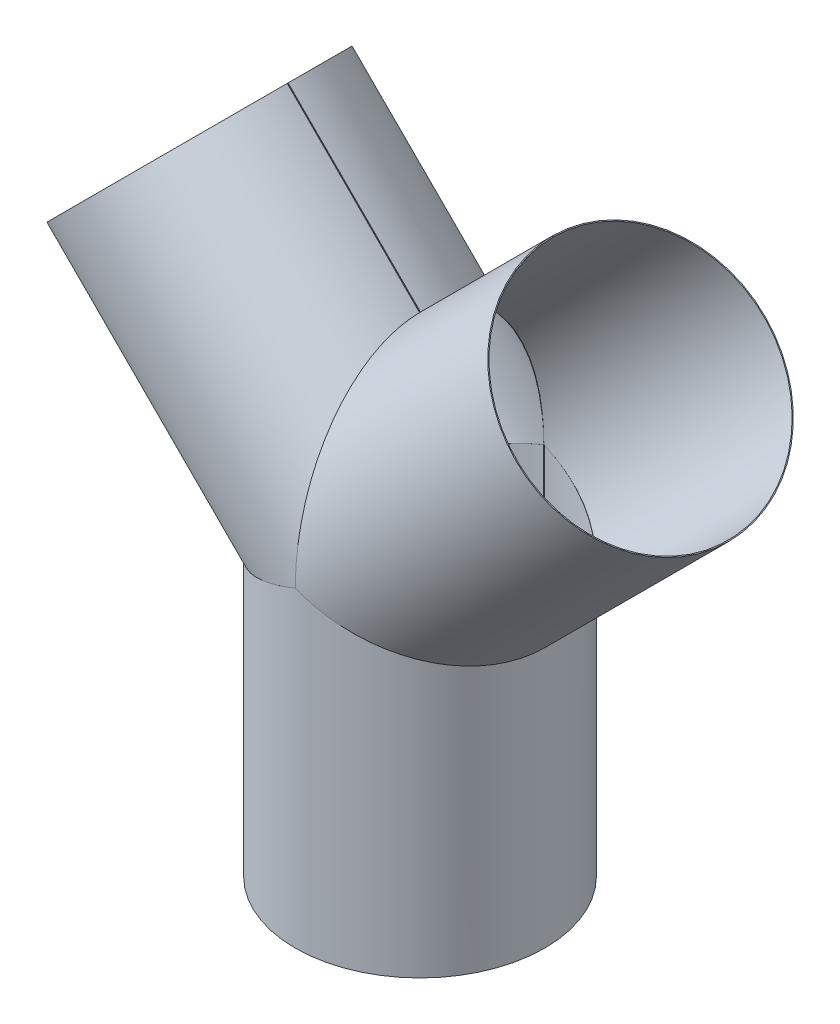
ISO-10303-21;
HEADER;
FILE_DESCRIPTION(('STEP AP214'),'2;1');
FILE_NAME('part.step','',(''),(''),'','','');
FILE_SCHEMA(('AUTOMOTIVE_DESIGN { 1 0 10303 214 1 1 1 1 }'));
ENDSEC;
DATA;
#1=APPLICATION_CONTEXT('core data for automotive mechanical design processes');
#2=APPLICATION_PROTOCOL_DEFINITION('international standard','automotive_design',2000,#1);
#3=PRODUCT_CONTEXT('',#1,'mechanical');
#4=PRODUCT('Part','Part','',(#3));
#5=PRODUCT_RELATED_PRODUCT_CATEGORY('part','',(#4));
#6=PRODUCT_DEFINITION_FORMATION('','',#4);
#7=PRODUCT_DEFINITION_CONTEXT('part definition',#1,'design');
#8=PRODUCT_DEFINITION('design','',#6,#7);
#9=PRODUCT_DEFINITION_SHAPE('','',#8);
#10=(LENGTH_UNIT() NAMED_UNIT(*) SI_UNIT(.MILLI.,.METRE.));
#11=(NAMED_UNIT(*) PLANE_ANGLE_UNIT() SI_UNIT($,.RADIAN.));
#12=(NAMED_UNIT(*) SI_UNIT($,.STERADIAN.) SOLID_ANGLE_UNIT());
#13=UNCERTAINTY_MEASURE_WITH_UNIT(LENGTH_MEASURE(1.E-05),#10,'distance_accuracy_value','');
#14=(GEOMETRIC_REPRESENTATION_CONTEXT(3) GLOBAL_UNCERTAINTY_ASSIGNED_CONTEXT((#13)) GLOBAL_UNIT_ASSIGNED_CONTEXT((#10,
#11,#12)) REPRESENTATION_CONTEXT('',''));
#15=CARTESIAN_POINT('',(0.,0.,0.));
#16=DIRECTION('',(0.,0.,1.));
#17=DIRECTION('',(1.,0.,0.));
#18=AXIS2_PLACEMENT_3D('',#15,#16,#17);
#19=CARTESIAN_POINT('',(0.,0.,0.));
#20=DIRECTION('',(-0.707106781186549,0.707106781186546,0.));
#21=DIRECTION('',(0.707106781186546,0.707106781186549,0.));
#22=AXIS2_PLACEMENT_3D('',#19,#20,#21);
#23=CYLINDRICAL_SURFACE('',#22,200.);
#24=CARTESIAN_POINT('',(0.,0.,0.));
#25=DIRECTION('',(-1.,0.,0.));
#26=DIRECTION('',(0.,1.,0.));
#27=AXIS2_PLACEMENT_3D('',#24,#25,#26);
#28=ELLIPSE('',#27,282.842712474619,200.);
#29=CARTESIAN_POINT('',(0.,282.840723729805,0.750000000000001));
#30=VERTEX_POINT('',#29);
#31=CARTESIAN_POINT('',(0.,0.,200.));
#32=VERTEX_POINT('',#31);
#33=EDGE_CURVE('E147',#30,#32,#28,.F.);
#34=ORIENTED_EDGE('',*,*,#33,.F.);
#35=DIRECTION('',(-0.707106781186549,0.707106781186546,0.));
#36=VECTOR('',#35,1.);
#37=CARTESIAN_POINT('',(141.420361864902,141.420361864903,0.750000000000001));
#38=LINE('',#37,#36);
#39=CARTESIAN_POINT('',(-212.133028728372,494.973752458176,0.750000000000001));
#40=VERTEX_POINT('',#39);
#41=EDGE_CURVE('E13',#30,#40,#38,.T.);
#42=ORIENTED_EDGE('',*,*,#41,.T.);
#43=CARTESIAN_POINT('',(-353.553390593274,353.553390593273,0.));
#44=DIRECTION('',(0.707106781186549,-0.707106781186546,0.));
#45=DIRECTION('',(0.707106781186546,0.707106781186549,0.));
#46=AXIS2_PLACEMENT_3D('',#43,#44,#45);
#47=CIRCLE('',#46,200.);
#48=CARTESIAN_POINT('',(-212.133028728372,494.973752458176,-0.750000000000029));
#49=VERTEX_POINT('',#48);
#50=EDGE_CURVE('E171',#40,#49,#47,.T.);
#51=ORIENTED_EDGE('',*,*,#50,.T.);
#52=DIRECTION('',(-0.707106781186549,0.707106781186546,0.));
#53=VECTOR('',#52,1.);
#54=CARTESIAN_POINT('',(141.420361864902,141.420361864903,-0.750000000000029));
#55=LINE('',#54,#53);
#56=CARTESIAN_POINT('',(0.,282.840723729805,-0.750000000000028));
#57=VERTEX_POINT('',#56);
#58=EDGE_CURVE('E90',#57,#49,#55,.T.);
#59=ORIENTED_EDGE('',*,*,#58,.F.);
#60=CARTESIAN_POINT('',(0.,0.,0.));
#61=DIRECTION('',(-1.,0.,0.));
#62=DIRECTION('',(0.,1.,0.));
#63=AXIS2_PLACEMENT_3D('',#60,#61,#62);
#64=ELLIPSE('',#63,282.842712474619,200.);
#65=CARTESIAN_POINT('',(0.,0.,-200.));
#66=VERTEX_POINT('',#65);
#67=EDGE_CURVE('E165',#66,#57,#64,.F.);
#68=ORIENTED_EDGE('',*,*,#67,.F.);
#69=CARTESIAN_POINT('',(0.,0.,0.));
#70=DIRECTION('',(-0.382683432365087,0.923879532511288,0.));
#71=DIRECTION('',(-0.923879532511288,-0.382683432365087,0.));
#72=AXIS2_PLACEMENT_3D('',#69,#70,#71);
#73=ELLIPSE('',#72,216.478440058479,200.);
#74=EDGE_CURVE('E159',#32,#66,#73,.F.);
#75=ORIENTED_EDGE('',*,*,#74,.F.);
#76=EDGE_LOOP('',(#34,#42,#51,#59,#68,#75));
#77=FACE_BOUND('',#76,.T.);
#78=ADVANCED_FACE('F87',(#77),#23,.T.);
#79=CARTESIAN_POINT('',(0.,0.,0.));
#80=DIRECTION('',(-0.707106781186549,0.707106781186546,0.));
#81=DIRECTION('',(0.707106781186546,0.707106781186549,0.));
#82=AXIS2_PLACEMENT_3D('',#79,#80,#81);
#83=CYLINDRICAL_SURFACE('',#82,198.5);
#84=CARTESIAN_POINT('',(0.,0.,0.));
#85=DIRECTION('',(-0.999992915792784,-0.00376408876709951,0.));
#86=DIRECTION('',(-0.00376408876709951,0.999992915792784,0.));
#87=AXIS2_PLACEMENT_3D('',#84,#85,#86);
#88=ELLIPSE('',#87,281.784048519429,198.5);
#89=CARTESIAN_POINT('',(0.,0.,-198.5));
#90=VERTEX_POINT('',#89);
#91=CARTESIAN_POINT('',(-1.06065271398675,281.780071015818,-0.744375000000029));
#92=VERTEX_POINT('',#91);
#93=EDGE_CURVE('E213',#90,#92,#88,.F.);
#94=ORIENTED_EDGE('',*,*,#93,.T.);
#95=DIRECTION('',(-0.707106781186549,0.707106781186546,0.));
#96=VECTOR('',#95,1.);
#97=CARTESIAN_POINT('',(140.359709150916,140.359709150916,-0.744375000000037));
#98=LINE('',#97,#96);
#99=CARTESIAN_POINT('',(-213.193681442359,493.913099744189,-0.744375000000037));
#100=VERTEX_POINT('',#99);
#101=EDGE_CURVE('E180',#92,#100,#98,.T.);
#102=ORIENTED_EDGE('',*,*,#101,.T.);
#103=CARTESIAN_POINT('',(-353.553390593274,353.553390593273,0.));
#104=DIRECTION('',(0.707106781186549,-0.707106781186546,0.));
#105=DIRECTION('',(0.,0.,-1.));
#106=AXIS2_PLACEMENT_3D('',#103,#104,#105);
#107=CIRCLE('',#106,198.5);
#108=CARTESIAN_POINT('',(-213.193681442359,493.913099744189,0.744375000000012));
#109=VERTEX_POINT('',#108);
#110=EDGE_CURVE('E177',#109,#100,#107,.T.);
#111=ORIENTED_EDGE('',*,*,#110,.F.);
#112=DIRECTION('',(-0.707106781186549,0.707106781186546,0.));
#113=VECTOR('',#112,1.);
#114=CARTESIAN_POINT('',(140.359709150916,140.359709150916,0.744375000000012));
#115=LINE('',#114,#113);
#116=CARTESIAN_POINT('',(-1.06065271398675,281.780071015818,0.744375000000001));
#117=VERTEX_POINT('',#116);
#118=EDGE_CURVE('E95',#117,#109,#115,.T.);
#119=ORIENTED_EDGE('',*,*,#118,.F.);
#120=CARTESIAN_POINT('',(0.,0.,0.));
#121=DIRECTION('',(-0.999992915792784,-0.00376408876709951,0.));
#122=DIRECTION('',(-0.00376408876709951,0.999992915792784,0.));
#123=AXIS2_PLACEMENT_3D('',#120,#121,#122);
#124=ELLIPSE('',#123,281.784048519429,198.5);
#125=CARTESIAN_POINT('',(0.,0.,198.5));
#126=VERTEX_POINT('',#125);
#127=EDGE_CURVE('E144',#117,#126,#124,.F.);
#128=ORIENTED_EDGE('',*,*,#127,.T.);
#129=CARTESIAN_POINT('',(0.,0.,0.));
#130=DIRECTION('',(-0.380216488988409,0.924897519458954,0.));
#131=DIRECTION('',(-0.924897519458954,-0.380216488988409,0.));
#132=AXIS2_PLACEMENT_3D('',#129,#130,#131);
#133=ELLIPSE('',#132,215.093386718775,198.5);
#134=EDGE_CURVE('E151',#126,#90,#133,.F.);
#135=ORIENTED_EDGE('',*,*,#134,.T.);
#136=EDGE_LOOP('',(#94,#102,#111,#119,#128,#135));
#137=FACE_BOUND('',#136,.T.);
#138=ADVANCED_FACE('F161',(#137),#83,.F.);
#139=CARTESIAN_POINT('',(141.420361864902,141.420361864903,0.750000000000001));
#140=DIRECTION('',(-0.002651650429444,-0.00265165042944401,0.999992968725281));
#141=DIRECTION('',(0.,-0.999996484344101,-0.00265165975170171));
#142=AXIS2_PLACEMENT_3D('',#139,#140,#141);
#143=PLANE('',#142);
#144=DIRECTION('',(0.707101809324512,0.707101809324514,0.00375));
#145=VECTOR('',#144,1.);
#146=CARTESIAN_POINT('',(0.,282.840723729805,0.750000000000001));
#147=LINE('',#146,#145);
#148=EDGE_CURVE('E163',#30,#117,#147,.F.);
#149=ORIENTED_EDGE('',*,*,#148,.T.);
#150=ORIENTED_EDGE('',*,*,#118,.T.);
#151=DIRECTION('',(-0.707101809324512,-0.707101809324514,-0.00374999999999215));
#152=VECTOR('',#151,1.);
#153=CARTESIAN_POINT('',(-212.133028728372,494.973752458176,0.750000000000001));
#154=LINE('',#153,#152);
#155=EDGE_CURVE('E103',#40,#109,#154,.T.);
#156=ORIENTED_EDGE('',*,*,#155,.F.);
#157=ORIENTED_EDGE('',*,*,#41,.F.);
#158=EDGE_LOOP('',(#149,#150,#156,#157));
#159=FACE_BOUND('',#158,.T.);
#160=ADVANCED_FACE('F199',(#159),#143,.F.);
#161=CARTESIAN_POINT('',(140.359709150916,140.359709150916,-0.744375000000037));
#162=DIRECTION('',(-0.00265165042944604,-0.00265165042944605,-0.999992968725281));
#163=DIRECTION('',(0.,0.999996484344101,-0.00265165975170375));
#164=AXIS2_PLACEMENT_3D('',#161,#162,#163);
#165=PLANE('',#164);
#166=DIRECTION('',(0.707101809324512,0.707101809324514,-0.00375000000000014));
#167=VECTOR('',#166,1.);
#168=CARTESIAN_POINT('',(0.,282.840723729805,-0.750000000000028));
#169=LINE('',#168,#167);
#170=EDGE_CURVE('E175',#57,#92,#169,.F.);
#171=ORIENTED_EDGE('',*,*,#170,.F.);
#172=ORIENTED_EDGE('',*,*,#58,.T.);
#173=DIRECTION('',(0.707101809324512,0.707101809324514,-0.00374999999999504));
#174=VECTOR('',#173,1.);
#175=CARTESIAN_POINT('',(-213.193681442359,493.913099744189,-0.744375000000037));
#176=LINE('',#175,#174);
#177=EDGE_CURVE('E174',#100,#49,#176,.T.);
#178=ORIENTED_EDGE('',*,*,#177,.F.);
#179=ORIENTED_EDGE('',*,*,#101,.F.);
#180=EDGE_LOOP('',(#171,#172,#178,#179));
#181=FACE_BOUND('',#180,.T.);
#182=ADVANCED_FACE('F186',(#181),#165,.F.);
#183=CARTESIAN_POINT('',(-353.553390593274,353.553390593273,0.));
#184=DIRECTION('',(-0.707106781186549,0.707106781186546,0.));
#185=DIRECTION('',(0.,0.,-1.));
#186=AXIS2_PLACEMENT_3D('',#183,#184,#185);
#187=PLANE('',#186);
#188=ORIENTED_EDGE('',*,*,#50,.F.);
#189=ORIENTED_EDGE('',*,*,#155,.T.);
#190=ORIENTED_EDGE('',*,*,#110,.T.);
#191=ORIENTED_EDGE('',*,*,#177,.T.);
#192=EDGE_LOOP('',(#188,#189,#190,#191));
#193=FACE_BOUND('',#192,.T.);
#194=ADVANCED_FACE('F190',(#193),#187,.T.);
#195=CARTESIAN_POINT('',(0.,282.842712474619,0.));
#196=CARTESIAN_POINT('',(-0.353553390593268,282.489159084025,0.));
#197=CARTESIAN_POINT('',(-0.707106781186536,282.135605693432,0.));
#198=CARTESIAN_POINT('',(-1.0606601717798,281.782052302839,0.));
#199=CARTESIAN_POINT('',(0.,282.842712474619,400.));
#200=CARTESIAN_POINT('',(-0.353553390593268,282.489159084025,399.));
#201=CARTESIAN_POINT('',(-0.707106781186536,282.135605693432,398.));
#202=CARTESIAN_POINT('',(-1.0606601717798,281.782052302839,397.));
#203=CARTESIAN_POINT('',(0.,-282.842712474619,400.));
#204=CARTESIAN_POINT('',(0.353553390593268,-282.489159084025,399.));
#205=CARTESIAN_POINT('',(0.707106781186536,-282.135605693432,398.));
#206=CARTESIAN_POINT('',(1.0606601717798,-281.782052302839,397.));
#207=CARTESIAN_POINT('',(0.,-282.842712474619,0.));
#208=CARTESIAN_POINT('',(0.353553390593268,-282.489159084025,0.));
#209=CARTESIAN_POINT('',(0.707106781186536,-282.135605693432,0.));
#210=CARTESIAN_POINT('',(1.0606601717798,-281.782052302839,0.));
#211=CARTESIAN_POINT('',(0.,-282.842712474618,-400.));
#212=CARTESIAN_POINT('',(0.353553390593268,-282.489159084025,-399.));
#213=CARTESIAN_POINT('',(0.707106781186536,-282.135605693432,-398.));
#214=CARTESIAN_POINT('',(1.0606601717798,-281.782052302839,-397.));
#215=CARTESIAN_POINT('',(0.,282.842712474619,-400.));
#216=CARTESIAN_POINT('',(-0.353553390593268,282.489159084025,-399.));
#217=CARTESIAN_POINT('',(-0.707106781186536,282.135605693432,-398.));
#218=CARTESIAN_POINT('',(-1.0606601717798,281.782052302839,-397.));
#219=CARTESIAN_POINT('',(0.,282.842712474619,0.));
#220=CARTESIAN_POINT('',(-0.353553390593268,282.489159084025,0.));
#221=CARTESIAN_POINT('',(-0.707106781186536,282.135605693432,0.));
#222=CARTESIAN_POINT('',(-1.0606601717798,281.782052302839,0.));
#223=(BOUNDED_SURFACE() B_SPLINE_SURFACE(3,3,((#195,#196,#197,#198),(#199,#200,#201,#202),(#203,
#204,#205,#206),(#207,#208,#209,#210),(#211,#212,#213,#214),(#215,#216,#217,#218),(#219,#220,
#221,#222)),.UNSPECIFIED.,.T.,.F.,.F.) B_SPLINE_SURFACE_WITH_KNOTS((4,3,4),(4,4),(0.,0.5,1.),
(0.,1.),.UNSPECIFIED.) GEOMETRIC_REPRESENTATION_ITEM() RATIONAL_B_SPLINE_SURFACE(((1.,1.,1.,1.),
(0.333333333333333,0.333333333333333,0.333333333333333,0.333333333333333),(0.333333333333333,
0.333333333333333,0.333333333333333,0.333333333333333),(1.,1.,1.,1.),(0.333333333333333,
0.333333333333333,0.333333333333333,0.333333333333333),(0.333333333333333,0.333333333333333,
0.333333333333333,0.333333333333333),(1.,1.,1.,1.))) REPRESENTATION_ITEM('') SURFACE());
#224=DIRECTION('',(0.,0.,1.));
#225=VECTOR('',#224,1.);
#226=CARTESIAN_POINT('',(0.,0.,200.));
#227=LINE('',#226,#225);
#228=EDGE_CURVE('E140',#32,#126,#227,.F.);
#229=ORIENTED_EDGE('',*,*,#228,.T.);
#230=ORIENTED_EDGE('',*,*,#127,.F.);
#231=ORIENTED_EDGE('',*,*,#148,.F.);
#232=ORIENTED_EDGE('',*,*,#33,.T.);
#233=EDGE_LOOP('',(#229,#230,#231,#232));
#234=FACE_BOUND('',#233,.T.);
#235=ADVANCED_FACE('F142',(#234),#223,.T.);
#236=CARTESIAN_POINT('',(0.,282.842712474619,0.));
#237=CARTESIAN_POINT('',(-0.353553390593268,282.489159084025,0.));
#238=CARTESIAN_POINT('',(-0.707106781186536,282.135605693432,0.));
#239=CARTESIAN_POINT('',(-1.0606601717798,281.782052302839,0.));
#240=CARTESIAN_POINT('',(0.,282.842712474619,400.));
#241=CARTESIAN_POINT('',(-0.353553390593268,282.489159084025,399.));
#242=CARTESIAN_POINT('',(-0.707106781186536,282.135605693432,398.));
#243=CARTESIAN_POINT('',(-1.0606601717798,281.782052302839,397.));
#244=CARTESIAN_POINT('',(0.,-282.842712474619,400.));
#245=CARTESIAN_POINT('',(0.353553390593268,-282.489159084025,399.));
#246=CARTESIAN_POINT('',(0.707106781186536,-282.135605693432,398.));
#247=CARTESIAN_POINT('',(1.0606601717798,-281.782052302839,397.));
#248=CARTESIAN_POINT('',(0.,-282.842712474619,0.));
#249=CARTESIAN_POINT('',(0.353553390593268,-282.489159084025,0.));
#250=CARTESIAN_POINT('',(0.707106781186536,-282.135605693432,0.));
#251=CARTESIAN_POINT('',(1.0606601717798,-281.782052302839,0.));
#252=CARTESIAN_POINT('',(0.,-282.842712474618,-400.));
#253=CARTESIAN_POINT('',(0.353553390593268,-282.489159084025,-399.));
#254=CARTESIAN_POINT('',(0.707106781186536,-282.135605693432,-398.));
#255=CARTESIAN_POINT('',(1.0606601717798,-281.782052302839,-397.));
#256=CARTESIAN_POINT('',(0.,282.842712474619,-400.));
#257=CARTESIAN_POINT('',(-0.353553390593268,282.489159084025,-399.));
#258=CARTESIAN_POINT('',(-0.707106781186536,282.135605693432,-398.));
#259=CARTESIAN_POINT('',(-1.0606601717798,281.782052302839,-397.));
#260=CARTESIAN_POINT('',(0.,282.842712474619,0.));
#261=CARTESIAN_POINT('',(-0.353553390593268,282.489159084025,0.));
#262=CARTESIAN_POINT('',(-0.707106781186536,282.135605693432,0.));
#263=CARTESIAN_POINT('',(-1.0606601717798,281.782052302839,0.));
#264=(BOUNDED_SURFACE() B_SPLINE_SURFACE(3,3,((#236,#237,#238,#239),(#240,#241,#242,#243),(#244,
#245,#246,#247),(#248,#249,#250,#251),(#252,#253,#254,#255),(#256,#257,#258,#259),(#260,#261,
#262,#263)),.UNSPECIFIED.,.T.,.F.,.F.) B_SPLINE_SURFACE_WITH_KNOTS((4,3,4),(4,4),(0.,0.5,1.),
(0.,1.),.UNSPECIFIED.) GEOMETRIC_REPRESENTATION_ITEM() RATIONAL_B_SPLINE_SURFACE(((1.,1.,1.,1.),
(0.333333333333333,0.333333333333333,0.333333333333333,0.333333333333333),(0.333333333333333,
0.333333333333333,0.333333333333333,0.333333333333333),(1.,1.,1.,1.),(0.333333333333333,
0.333333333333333,0.333333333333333,0.333333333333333),(0.333333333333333,0.333333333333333,
0.333333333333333,0.333333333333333),(1.,1.,1.,1.))) REPRESENTATION_ITEM('') SURFACE());
#265=DIRECTION('',(0.,0.,-1.));
#266=VECTOR('',#265,1.);
#267=CARTESIAN_POINT('',(0.,0.,-200.));
#268=LINE('',#267,#266);
#269=EDGE_CURVE('E155',#66,#90,#268,.F.);
#270=ORIENTED_EDGE('',*,*,#170,.T.);
#271=ORIENTED_EDGE('',*,*,#93,.F.);
#272=ORIENTED_EDGE('',*,*,#269,.F.);
#273=ORIENTED_EDGE('',*,*,#67,.T.);
#274=EDGE_LOOP('',(#270,#271,#272,#273));
#275=FACE_BOUND('',#274,.T.);
#276=ADVANCED_FACE('F197',(#275),#264,.T.);
#277=CARTESIAN_POINT('',(-200.000000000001,-82.8427124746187,0.));
#278=CARTESIAN_POINT('',(-199.646446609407,-82.4891590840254,0.));
#279=CARTESIAN_POINT('',(-199.292893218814,-82.1356056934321,0.));
#280=CARTESIAN_POINT('',(-198.939339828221,-81.7820523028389,0.));
#281=CARTESIAN_POINT('',(-200.000000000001,-82.8427124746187,-400.));
#282=CARTESIAN_POINT('',(-199.646446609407,-82.4891590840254,-399.));
#283=CARTESIAN_POINT('',(-199.292893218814,-82.1356056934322,-398.));
#284=CARTESIAN_POINT('',(-198.939339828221,-81.7820523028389,-397.));
#285=CARTESIAN_POINT('',(200.000000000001,82.8427124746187,-400.));
#286=CARTESIAN_POINT('',(199.646446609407,82.4891590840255,-399.));
#287=CARTESIAN_POINT('',(199.292893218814,82.1356056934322,-398.));
#288=CARTESIAN_POINT('',(198.939339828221,81.7820523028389,-397.));
#289=CARTESIAN_POINT('',(200.000000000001,82.8427124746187,0.));
#290=CARTESIAN_POINT('',(199.646446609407,82.4891590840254,0.));
#291=CARTESIAN_POINT('',(199.292893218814,82.1356056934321,0.));
#292=CARTESIAN_POINT('',(198.939339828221,81.7820523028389,0.));
#293=CARTESIAN_POINT('',(200.000000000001,82.8427124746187,400.));
#294=CARTESIAN_POINT('',(199.646446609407,82.4891590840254,399.));
#295=CARTESIAN_POINT('',(199.292893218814,82.1356056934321,398.));
#296=CARTESIAN_POINT('',(198.939339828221,81.7820523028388,397.));
#297=CARTESIAN_POINT('',(-200.000000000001,-82.8427124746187,400.));
#298=CARTESIAN_POINT('',(-199.646446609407,-82.4891590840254,399.));
#299=CARTESIAN_POINT('',(-199.292893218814,-82.1356056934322,398.));
#300=CARTESIAN_POINT('',(-198.939339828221,-81.7820523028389,397.));
#301=CARTESIAN_POINT('',(-200.000000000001,-82.8427124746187,0.));
#302=CARTESIAN_POINT('',(-199.646446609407,-82.4891590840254,0.));
#303=CARTESIAN_POINT('',(-199.292893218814,-82.1356056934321,0.));
#304=CARTESIAN_POINT('',(-198.939339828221,-81.7820523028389,0.));
#305=(BOUNDED_SURFACE() B_SPLINE_SURFACE(3,3,((#277,#278,#279,#280),(#281,#282,#283,#284),(#285,
#286,#287,#288),(#289,#290,#291,#292),(#293,#294,#295,#296),(#297,#298,#299,#300),(#301,#302,
#303,#304)),.UNSPECIFIED.,.T.,.F.,.F.) B_SPLINE_SURFACE_WITH_KNOTS((4,3,4),(4,4),(0.,0.5,1.),
(0.,1.),.UNSPECIFIED.) GEOMETRIC_REPRESENTATION_ITEM() RATIONAL_B_SPLINE_SURFACE(((1.,1.,1.,1.),
(0.333333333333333,0.333333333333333,0.333333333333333,0.333333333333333),(0.333333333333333,
0.333333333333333,0.333333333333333,0.333333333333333),(1.,1.,1.,1.),(0.333333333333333,
0.333333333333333,0.333333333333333,0.333333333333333),(0.333333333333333,0.333333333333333,
0.333333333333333,0.333333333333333),(1.,1.,1.,1.))) REPRESENTATION_ITEM('') SURFACE());
#306=ORIENTED_EDGE('',*,*,#269,.T.);
#307=ORIENTED_EDGE('',*,*,#134,.F.);
#308=ORIENTED_EDGE('',*,*,#228,.F.);
#309=ORIENTED_EDGE('',*,*,#74,.T.);
#310=EDGE_LOOP('',(#306,#307,#308,#309));
#311=FACE_BOUND('',#310,.T.);
#312=ADVANCED_FACE('F154',(#311),#305,.T.);
#313=CLOSED_SHELL('',(#78,#138,#160,#182,#194,#235,#276,#312));
#314=MANIFOLD_SOLID_BREP('B2',#313);
#315=CARTESIAN_POINT('',(0.,0.,0.));
#316=DIRECTION('',(0.,-1.,0.));
#317=DIRECTION('',(0.,0.,-1.));
#318=AXIS2_PLACEMENT_3D('',#315,#316,#317);
#319=CYLINDRICAL_SURFACE('',#318,200.);
#320=CARTESIAN_POINT('',(0.,0.,0.));
#321=DIRECTION('',(-0.382683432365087,-0.923879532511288,0.));
#322=DIRECTION('',(0.923879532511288,-0.382683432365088,0.));
#323=AXIS2_PLACEMENT_3D('',#320,#321,#322);
#324=ELLIPSE('',#323,216.478440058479,200.);
#325=CARTESIAN_POINT('',(0.750000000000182,-0.310660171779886,-199.998593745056));
#326=VERTEX_POINT('',#325);
#327=CARTESIAN_POINT('',(0.,0.,200.));
#328=VERTEX_POINT('',#327);
#329=EDGE_CURVE('E359',#326,#328,#324,.T.);
#330=ORIENTED_EDGE('',*,*,#329,.T.);
#331=CARTESIAN_POINT('',(0.,0.,0.));
#332=DIRECTION('',(-0.382683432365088,0.923879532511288,0.));
#333=DIRECTION('',(-0.923879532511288,-0.382683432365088,0.));
#334=AXIS2_PLACEMENT_3D('',#331,#332,#333);
#335=ELLIPSE('',#334,216.478440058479,200.);
#336=CARTESIAN_POINT('',(-0.749999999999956,-0.310660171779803,-199.998593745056));
#337=VERTEX_POINT('',#336);
#338=EDGE_CURVE('E361',#337,#328,#335,.T.);
#339=ORIENTED_EDGE('',*,*,#338,.F.);
#340=DIRECTION('',(0.,-1.,0.));
#341=VECTOR('',#340,1.);
#342=CARTESIAN_POINT('',(-0.749999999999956,0.,-199.998593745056));
#343=LINE('',#342,#341);
#344=CARTESIAN_POINT('',(-0.749999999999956,-500.,-199.998593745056));
#345=VERTEX_POINT('',#344);
#346=EDGE_CURVE('E326',#337,#345,#343,.T.);
#347=ORIENTED_EDGE('',*,*,#346,.T.);
#348=CARTESIAN_POINT('',(0.,-500.,0.));
#349=DIRECTION('',(0.,1.,0.));
#350=DIRECTION('',(0.,0.,1.));
#351=AXIS2_PLACEMENT_3D('',#348,#349,#350);
#352=CIRCLE('',#351,200.);
#353=CARTESIAN_POINT('',(0.750000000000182,-500.,-199.998593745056));
#354=VERTEX_POINT('',#353);
#355=EDGE_CURVE('E374',#345,#354,#352,.T.);
#356=ORIENTED_EDGE('',*,*,#355,.T.);
#357=DIRECTION('',(0.,-1.,0.));
#358=VECTOR('',#357,1.);
#359=CARTESIAN_POINT('',(0.750000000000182,0.,-199.998593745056));
#360=LINE('',#359,#358);
#361=EDGE_CURVE('E319',#326,#354,#360,.T.);
#362=ORIENTED_EDGE('',*,*,#361,.F.);
#363=EDGE_LOOP('',(#330,#339,#347,#356,#362));
#364=FACE_BOUND('',#363,.T.);
#365=ADVANCED_FACE('F312',(#364),#319,.T.);
#366=CARTESIAN_POINT('',(0.,0.,0.));
#367=DIRECTION('',(0.,-1.,0.));
#368=DIRECTION('',(0.,0.,-1.));
#369=AXIS2_PLACEMENT_3D('',#366,#367,#368);
#370=CYLINDRICAL_SURFACE('',#369,198.5);
#371=CARTESIAN_POINT('',(0.,0.,0.));
#372=DIRECTION('',(-0.382683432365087,-0.923879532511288,0.));
#373=DIRECTION('',(0.923879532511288,-0.382683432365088,0.));
#374=AXIS2_PLACEMENT_3D('',#371,#372,#373);
#375=ELLIPSE('',#374,214.85485175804,198.5);
#376=CARTESIAN_POINT('',(0.744375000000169,-0.308330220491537,-198.498604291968));
#377=VERTEX_POINT('',#376);
#378=CARTESIAN_POINT('',(0.,0.,198.5));
#379=VERTEX_POINT('',#378);
#380=EDGE_CURVE('E366',#377,#379,#375,.T.);
#381=ORIENTED_EDGE('',*,*,#380,.F.);
#382=DIRECTION('',(0.,-1.,0.));
#383=VECTOR('',#382,1.);
#384=CARTESIAN_POINT('',(0.744375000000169,0.,-198.498604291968));
#385=LINE('',#384,#383);
#386=CARTESIAN_POINT('',(0.744375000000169,-500.,-198.498604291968));
#387=VERTEX_POINT('',#386);
#388=EDGE_CURVE('E392',#377,#387,#385,.T.);
#389=ORIENTED_EDGE('',*,*,#388,.T.);
#390=CARTESIAN_POINT('',(0.,-500.,0.));
#391=DIRECTION('',(0.,1.,0.));
#392=DIRECTION('',(1.,0.,0.));
#393=AXIS2_PLACEMENT_3D('',#390,#391,#392);
#394=CIRCLE('',#393,198.5);
#395=CARTESIAN_POINT('',(-0.744374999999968,-500.,-198.498604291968));
#396=VERTEX_POINT('',#395);
#397=EDGE_CURVE('E384',#396,#387,#394,.T.);
#398=ORIENTED_EDGE('',*,*,#397,.F.);
#399=DIRECTION('',(0.,-1.,0.));
#400=VECTOR('',#399,1.);
#401=CARTESIAN_POINT('',(-0.744374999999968,0.,-198.498604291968));
#402=LINE('',#401,#400);
#403=CARTESIAN_POINT('',(-0.744374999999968,-0.308330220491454,-198.498604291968));
#404=VERTEX_POINT('',#403);
#405=EDGE_CURVE('E334',#404,#396,#402,.T.);
#406=ORIENTED_EDGE('',*,*,#405,.F.);
#407=CARTESIAN_POINT('',(0.,0.,0.));
#408=DIRECTION('',(-0.382683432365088,0.923879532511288,0.));
#409=DIRECTION('',(-0.923879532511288,-0.382683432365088,0.));
#410=AXIS2_PLACEMENT_3D('',#407,#408,#409);
#411=ELLIPSE('',#410,214.85485175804,198.5);
#412=EDGE_CURVE('E375',#404,#379,#411,.T.);
#413=ORIENTED_EDGE('',*,*,#412,.T.);
#414=EDGE_LOOP('',(#381,#389,#398,#406,#413));
#415=FACE_BOUND('',#414,.T.);
#416=ADVANCED_FACE('F401',(#415),#370,.F.);
#417=CARTESIAN_POINT('',(-0.749999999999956,0.,-199.998593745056));
#418=DIRECTION('',(0.999992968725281,0.,-0.00374999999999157));
#419=DIRECTION('',(-0.00374999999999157,0.,-0.999992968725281));
#420=AXIS2_PLACEMENT_3D('',#417,#418,#419);
#421=PLANE('',#420);
#422=ORIENTED_EDGE('',*,*,#346,.F.);
#423=DIRECTION('',(0.00374999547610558,0.00155329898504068,0.999991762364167));
#424=VECTOR('',#423,1.);
#425=CARTESIAN_POINT('',(-0.749998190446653,-0.310659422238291,-199.998111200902));
#426=LINE('',#425,#424);
#427=EDGE_CURVE('E365',#337,#404,#426,.T.);
#428=ORIENTED_EDGE('',*,*,#427,.T.);
#429=ORIENTED_EDGE('',*,*,#405,.T.);
#430=DIRECTION('',(0.00374999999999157,0.,0.999992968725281));
#431=VECTOR('',#430,1.);
#432=CARTESIAN_POINT('',(-0.749999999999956,-500.,-199.998593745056));
#433=LINE('',#432,#431);
#434=EDGE_CURVE('E387',#345,#396,#433,.T.);
#435=ORIENTED_EDGE('',*,*,#434,.F.);
#436=EDGE_LOOP('',(#422,#428,#429,#435));
#437=FACE_BOUND('',#436,.T.);
#438=ADVANCED_FACE('F404',(#437),#421,.T.);
#439=CARTESIAN_POINT('',(0.744375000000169,0.,-198.498604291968));
#440=DIRECTION('',(-0.999992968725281,0.,-0.00375000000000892));
#441=DIRECTION('',(-0.00375000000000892,0.,0.999992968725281));
#442=AXIS2_PLACEMENT_3D('',#439,#440,#441);
#443=PLANE('',#442);
#444=DIRECTION('',(-0.00374999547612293,0.00155329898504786,0.999991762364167));
#445=VECTOR('',#444,1.);
#446=CARTESIAN_POINT('',(0.744373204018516,-0.308329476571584,-198.498125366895));
#447=LINE('',#446,#445);
#448=EDGE_CURVE('E397',#326,#377,#447,.T.);
#449=ORIENTED_EDGE('',*,*,#448,.F.);
#450=ORIENTED_EDGE('',*,*,#361,.T.);
#451=DIRECTION('',(0.00375000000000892,0.,-0.999992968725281));
#452=VECTOR('',#451,1.);
#453=CARTESIAN_POINT('',(0.744375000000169,-500.,-198.498604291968));
#454=LINE('',#453,#452);
#455=EDGE_CURVE('E377',#387,#354,#454,.T.);
#456=ORIENTED_EDGE('',*,*,#455,.F.);
#457=ORIENTED_EDGE('',*,*,#388,.F.);
#458=EDGE_LOOP('',(#449,#450,#456,#457));
#459=FACE_BOUND('',#458,.T.);
#460=ADVANCED_FACE('F395',(#459),#443,.T.);
#461=CARTESIAN_POINT('',(0.,-500.,0.));
#462=DIRECTION('',(0.,1.,0.));
#463=DIRECTION('',(1.,0.,0.));
#464=AXIS2_PLACEMENT_3D('',#461,#462,#463);
#465=PLANE('',#464);
#466=ORIENTED_EDGE('',*,*,#355,.F.);
#467=ORIENTED_EDGE('',*,*,#434,.T.);
#468=ORIENTED_EDGE('',*,*,#397,.T.);
#469=ORIENTED_EDGE('',*,*,#455,.T.);
#470=EDGE_LOOP('',(#466,#467,#468,#469));
#471=FACE_BOUND('',#470,.T.);
#472=ADVANCED_FACE('F399',(#471),#465,.F.);
#473=CARTESIAN_POINT('',(0.,0.,-200.));
#474=DIRECTION('',(-0.382683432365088,0.923879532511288,0.));
#475=DIRECTION('',(-0.923879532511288,-0.382683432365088,0.));
#476=AXIS2_PLACEMENT_3D('',#473,#474,#475);
#477=PLANE('',#476);
#478=ORIENTED_EDGE('',*,*,#338,.T.);
#479=DIRECTION('',(0.,0.,1.));
#480=VECTOR('',#479,1.);
#481=CARTESIAN_POINT('',(0.,0.,0.));
#482=LINE('',#481,#480);
#483=EDGE_CURVE('E85',#379,#328,#482,.T.);
#484=ORIENTED_EDGE('',*,*,#483,.F.);
#485=ORIENTED_EDGE('',*,*,#412,.F.);
#486=ORIENTED_EDGE('',*,*,#427,.F.);
#487=EDGE_LOOP('',(#478,#484,#485,#486));
#488=FACE_BOUND('',#487,.T.);
#489=ADVANCED_FACE('F373',(#488),#477,.T.);
#490=CARTESIAN_POINT('',(0.,0.,-200.));
#491=DIRECTION('',(-0.382683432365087,-0.923879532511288,0.));
#492=DIRECTION('',(0.923879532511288,-0.382683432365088,0.));
#493=AXIS2_PLACEMENT_3D('',#490,#491,#492);
#494=PLANE('',#493);
#495=ORIENTED_EDGE('',*,*,#329,.F.);
#496=ORIENTED_EDGE('',*,*,#448,.T.);
#497=ORIENTED_EDGE('',*,*,#380,.T.);
#498=ORIENTED_EDGE('',*,*,#483,.T.);
#499=EDGE_LOOP('',(#495,#496,#497,#498));
#500=FACE_BOUND('',#499,.T.);
#501=ADVANCED_FACE('F369',(#500),#494,.F.);
#502=CLOSED_SHELL('',(#365,#416,#438,#460,#472,#489,#501));
#503=MANIFOLD_SOLID_BREP('B7',#502);
#504=CARTESIAN_POINT('',(0.,0.,0.));
#505=DIRECTION('',(0.707106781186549,0.707106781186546,0.));
#506=DIRECTION('',(-0.707106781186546,0.707106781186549,0.));
#507=AXIS2_PLACEMENT_3D('',#504,#505,#506);
#508=CYLINDRICAL_SURFACE('',#507,200.);
#509=CARTESIAN_POINT('',(0.,0.,0.));
#510=DIRECTION('',(-1.,0.,0.));
#511=DIRECTION('',(0.,1.,0.));
#512=AXIS2_PLACEMENT_3D('',#509,#510,#511);
#513=ELLIPSE('',#512,282.842712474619,200.);
#514=CARTESIAN_POINT('',(0.,282.840723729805,0.750000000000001));
#515=VERTEX_POINT('',#514);
#516=CARTESIAN_POINT('',(0.,0.,200.));
#517=VERTEX_POINT('',#516);
#518=EDGE_CURVE('E520',#515,#517,#513,.F.);
#519=ORIENTED_EDGE('',*,*,#518,.T.);
#520=CARTESIAN_POINT('',(0.,0.,0.));
#521=DIRECTION('',(-0.382683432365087,-0.923879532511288,0.));
#522=DIRECTION('',(0.923879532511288,-0.382683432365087,0.));
#523=AXIS2_PLACEMENT_3D('',#520,#521,#522);
#524=ELLIPSE('',#523,216.478440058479,200.);
#525=CARTESIAN_POINT('',(0.,0.,-200.));
#526=VERTEX_POINT('',#525);
#527=EDGE_CURVE('E516',#517,#526,#524,.F.);
#528=ORIENTED_EDGE('',*,*,#527,.T.);
#529=CARTESIAN_POINT('',(0.,0.,0.));
#530=DIRECTION('',(-1.,0.,0.));
#531=DIRECTION('',(0.,1.,0.));
#532=AXIS2_PLACEMENT_3D('',#529,#530,#531);
#533=ELLIPSE('',#532,282.842712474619,200.);
#534=CARTESIAN_POINT('',(0.,282.840723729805,-0.750000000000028));
#535=VERTEX_POINT('',#534);
#536=EDGE_CURVE('E531',#526,#535,#533,.F.);
#537=ORIENTED_EDGE('',*,*,#536,.T.);
#538=DIRECTION('',(0.707106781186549,0.707106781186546,0.));
#539=VECTOR('',#538,1.);
#540=CARTESIAN_POINT('',(-141.420361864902,141.420361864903,-0.750000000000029));
#541=LINE('',#540,#539);
#542=CARTESIAN_POINT('',(212.133028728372,494.973752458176,-0.750000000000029));
#543=VERTEX_POINT('',#542);
#544=EDGE_CURVE('E460',#535,#543,#541,.T.);
#545=ORIENTED_EDGE('',*,*,#544,.T.);
#546=CARTESIAN_POINT('',(353.553390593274,353.553390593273,0.));
#547=DIRECTION('',(0.707106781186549,0.707106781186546,0.));
#548=DIRECTION('',(-0.707106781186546,0.707106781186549,0.));
#549=AXIS2_PLACEMENT_3D('',#546,#547,#548);
#550=CIRCLE('',#549,200.);
#551=CARTESIAN_POINT('',(212.133028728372,494.973752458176,0.750000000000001));
#552=VERTEX_POINT('',#551);
#553=EDGE_CURVE('E538',#552,#543,#550,.T.);
#554=ORIENTED_EDGE('',*,*,#553,.F.);
#555=DIRECTION('',(0.707106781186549,0.707106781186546,0.));
#556=VECTOR('',#555,1.);
#557=CARTESIAN_POINT('',(-141.420361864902,141.420361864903,0.750000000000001));
#558=LINE('',#557,#556);
#559=EDGE_CURVE('E310',#515,#552,#558,.T.);
#560=ORIENTED_EDGE('',*,*,#559,.F.);
#561=EDGE_LOOP('',(#519,#528,#537,#545,#554,#560));
#562=FACE_BOUND('',#561,.T.);
#563=ADVANCED_FACE('F457',(#562),#508,.T.);
#564=CARTESIAN_POINT('',(0.,0.,0.));
#565=DIRECTION('',(0.707106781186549,0.707106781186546,0.));
#566=DIRECTION('',(-0.707106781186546,0.707106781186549,0.));
#567=AXIS2_PLACEMENT_3D('',#564,#565,#566);
#568=CYLINDRICAL_SURFACE('',#567,198.5);
#569=CARTESIAN_POINT('',(0.,0.,0.));
#570=DIRECTION('',(-0.999992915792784,0.00376408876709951,0.));
#571=DIRECTION('',(0.00376408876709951,0.999992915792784,0.));
#572=AXIS2_PLACEMENT_3D('',#569,#570,#571);
#573=ELLIPSE('',#572,281.784048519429,198.5);
#574=CARTESIAN_POINT('',(0.,0.,-198.5));
#575=VERTEX_POINT('',#574);
#576=CARTESIAN_POINT('',(1.06065271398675,281.780071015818,-0.744375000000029));
#577=VERTEX_POINT('',#576);
#578=EDGE_CURVE('E526',#575,#577,#573,.F.);
#579=ORIENTED_EDGE('',*,*,#578,.F.);
#580=CARTESIAN_POINT('',(0.,0.,0.));
#581=DIRECTION('',(-0.380216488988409,-0.924897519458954,0.));
#582=DIRECTION('',(0.924897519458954,-0.380216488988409,0.));
#583=AXIS2_PLACEMENT_3D('',#580,#581,#582);
#584=ELLIPSE('',#583,215.093386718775,198.5);
#585=CARTESIAN_POINT('',(0.,0.,198.5));
#586=VERTEX_POINT('',#585);
#587=EDGE_CURVE('E513',#586,#575,#584,.F.);
#588=ORIENTED_EDGE('',*,*,#587,.F.);
#589=CARTESIAN_POINT('',(0.,0.,0.));
#590=DIRECTION('',(-0.999992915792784,0.00376408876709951,0.));
#591=DIRECTION('',(0.00376408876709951,0.999992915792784,0.));
#592=AXIS2_PLACEMENT_3D('',#589,#590,#591);
#593=ELLIPSE('',#592,281.784048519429,198.5);
#594=CARTESIAN_POINT('',(1.06065271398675,281.780071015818,0.744375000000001));
#595=VERTEX_POINT('',#594);
#596=EDGE_CURVE('E524',#595,#586,#593,.F.);
#597=ORIENTED_EDGE('',*,*,#596,.F.);
#598=DIRECTION('',(0.707106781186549,0.707106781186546,0.));
#599=VECTOR('',#598,1.);
#600=CARTESIAN_POINT('',(-140.359709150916,140.359709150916,0.744375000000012));
#601=LINE('',#600,#599);
#602=CARTESIAN_POINT('',(213.193681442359,493.913099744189,0.744375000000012));
#603=VERTEX_POINT('',#602);
#604=EDGE_CURVE('E465',#595,#603,#601,.T.);
#605=ORIENTED_EDGE('',*,*,#604,.T.);
#606=CARTESIAN_POINT('',(353.553390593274,353.553390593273,0.));
#607=DIRECTION('',(0.707106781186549,0.707106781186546,0.));
#608=DIRECTION('',(0.,0.,-1.));
#609=AXIS2_PLACEMENT_3D('',#606,#607,#608);
#610=CIRCLE('',#609,198.5);
#611=CARTESIAN_POINT('',(213.193681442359,493.913099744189,-0.744375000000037));
#612=VERTEX_POINT('',#611);
#613=EDGE_CURVE('E545',#603,#612,#610,.T.);
#614=ORIENTED_EDGE('',*,*,#613,.T.);
#615=DIRECTION('',(0.707106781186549,0.707106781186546,0.));
#616=VECTOR('',#615,1.);
#617=CARTESIAN_POINT('',(-140.359709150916,140.359709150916,-0.744375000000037));
#618=LINE('',#617,#616);
#619=EDGE_CURVE('E549',#577,#612,#618,.T.);
#620=ORIENTED_EDGE('',*,*,#619,.F.);
#621=EDGE_LOOP('',(#579,#588,#597,#605,#614,#620));
#622=FACE_BOUND('',#621,.T.);
#623=ADVANCED_FACE('F523',(#622),#568,.F.);
#624=CARTESIAN_POINT('',(-141.420361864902,141.420361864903,0.750000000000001));
#625=DIRECTION('',(0.002651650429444,-0.00265165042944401,0.999992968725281));
#626=DIRECTION('',(0.,-0.999996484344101,-0.00265165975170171));
#627=AXIS2_PLACEMENT_3D('',#624,#625,#626);
#628=PLANE('',#627);
#629=DIRECTION('',(-0.707101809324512,0.707101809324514,0.00375));
#630=VECTOR('',#629,1.);
#631=CARTESIAN_POINT('',(0.,282.840723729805,0.750000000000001));
#632=LINE('',#631,#630);
#633=EDGE_CURVE('E529',#515,#595,#632,.F.);
#634=ORIENTED_EDGE('',*,*,#633,.F.);
#635=ORIENTED_EDGE('',*,*,#559,.T.);
#636=DIRECTION('',(0.707101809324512,-0.707101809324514,-0.00374999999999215));
#637=VECTOR('',#636,1.);
#638=CARTESIAN_POINT('',(212.133028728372,494.973752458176,0.750000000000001));
#639=LINE('',#638,#637);
#640=EDGE_CURVE('E547',#552,#603,#639,.T.);
#641=ORIENTED_EDGE('',*,*,#640,.T.);
#642=ORIENTED_EDGE('',*,*,#604,.F.);
#643=EDGE_LOOP('',(#634,#635,#641,#642));
#644=FACE_BOUND('',#643,.T.);
#645=ADVANCED_FACE('F562',(#644),#628,.F.);
#646=CARTESIAN_POINT('',(-140.359709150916,140.359709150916,-0.744375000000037));
#647=DIRECTION('',(0.00265165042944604,-0.00265165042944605,-0.999992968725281));
#648=DIRECTION('',(0.,0.999996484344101,-0.00265165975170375));
#649=AXIS2_PLACEMENT_3D('',#646,#647,#648);
#650=PLANE('',#649);
#651=DIRECTION('',(-0.707101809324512,0.707101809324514,-0.00375000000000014));
#652=VECTOR('',#651,1.);
#653=CARTESIAN_POINT('',(0.,282.840723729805,-0.750000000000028));
#654=LINE('',#653,#652);
#655=EDGE_CURVE('E542',#535,#577,#654,.F.);
#656=ORIENTED_EDGE('',*,*,#655,.T.);
#657=ORIENTED_EDGE('',*,*,#619,.T.);
#658=DIRECTION('',(-0.707101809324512,0.707101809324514,-0.00374999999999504));
#659=VECTOR('',#658,1.);
#660=CARTESIAN_POINT('',(213.193681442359,493.913099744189,-0.744375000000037));
#661=LINE('',#660,#659);
#662=EDGE_CURVE('E541',#612,#543,#661,.T.);
#663=ORIENTED_EDGE('',*,*,#662,.T.);
#664=ORIENTED_EDGE('',*,*,#544,.F.);
#665=EDGE_LOOP('',(#656,#657,#663,#664));
#666=FACE_BOUND('',#665,.T.);
#667=ADVANCED_FACE('F558',(#666),#650,.F.);
#668=CARTESIAN_POINT('',(353.553390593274,353.553390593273,0.));
#669=DIRECTION('',(0.707106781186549,0.707106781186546,0.));
#670=DIRECTION('',(0.,0.,-1.));
#671=AXIS2_PLACEMENT_3D('',#668,#669,#670);
#672=PLANE('',#671);
#673=ORIENTED_EDGE('',*,*,#553,.T.);
#674=ORIENTED_EDGE('',*,*,#662,.F.);
#675=ORIENTED_EDGE('',*,*,#613,.F.);
#676=ORIENTED_EDGE('',*,*,#640,.F.);
#677=EDGE_LOOP('',(#673,#674,#675,#676));
#678=FACE_BOUND('',#677,.T.);
#679=ADVANCED_FACE('F561',(#678),#672,.T.);
#680=CARTESIAN_POINT('',(0.,282.842712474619,0.));
#681=CARTESIAN_POINT('',(0.353553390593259,282.489159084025,0.));
#682=CARTESIAN_POINT('',(0.707106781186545,282.135605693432,0.));
#683=CARTESIAN_POINT('',(1.0606601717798,281.782052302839,0.));
#684=CARTESIAN_POINT('',(0.,282.842712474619,400.));
#685=CARTESIAN_POINT('',(0.353553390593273,282.489159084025,399.));
#686=CARTESIAN_POINT('',(0.707106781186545,282.135605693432,398.));
#687=CARTESIAN_POINT('',(1.06066017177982,281.782052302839,397.));
#688=CARTESIAN_POINT('',(0.,-282.842712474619,400.));
#689=CARTESIAN_POINT('',(-0.353553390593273,-282.489159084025,399.));
#690=CARTESIAN_POINT('',(-0.707106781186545,-282.135605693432,398.));
#691=CARTESIAN_POINT('',(-1.06066017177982,-281.782052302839,397.));
#692=CARTESIAN_POINT('',(0.,-282.842712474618,0.));
#693=CARTESIAN_POINT('',(-0.353553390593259,-282.489159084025,0.));
#694=CARTESIAN_POINT('',(-0.707106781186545,-282.135605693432,0.));
#695=CARTESIAN_POINT('',(-1.0606601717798,-281.782052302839,0.));
#696=CARTESIAN_POINT('',(0.,-282.842712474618,-400.));
#697=CARTESIAN_POINT('',(-0.353553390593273,-282.489159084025,-399.));
#698=CARTESIAN_POINT('',(-0.707106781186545,-282.135605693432,-398.));
#699=CARTESIAN_POINT('',(-1.06066017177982,-281.782052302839,-397.));
#700=CARTESIAN_POINT('',(0.,282.842712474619,-400.));
#701=CARTESIAN_POINT('',(0.353553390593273,282.489159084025,-399.));
#702=CARTESIAN_POINT('',(0.707106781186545,282.135605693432,-398.));
#703=CARTESIAN_POINT('',(1.06066017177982,281.782052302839,-397.));
#704=CARTESIAN_POINT('',(0.,282.842712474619,0.));
#705=CARTESIAN_POINT('',(0.353553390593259,282.489159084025,0.));
#706=CARTESIAN_POINT('',(0.707106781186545,282.135605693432,0.));
#707=CARTESIAN_POINT('',(1.0606601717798,281.782052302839,0.));
#708=(BOUNDED_SURFACE() B_SPLINE_SURFACE(3,3,((#680,#681,#682,#683),(#684,#685,#686,#687),(#688,
#689,#690,#691),(#692,#693,#694,#695),(#696,#697,#698,#699),(#700,#701,#702,#703),(#704,#705,
#706,#707)),.UNSPECIFIED.,.T.,.F.,.F.) B_SPLINE_SURFACE_WITH_KNOTS((4,3,4),(4,4),(0.,0.5,1.),
(0.,1.),.UNSPECIFIED.) GEOMETRIC_REPRESENTATION_ITEM() RATIONAL_B_SPLINE_SURFACE(((1.,1.,1.,1.),
(0.333333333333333,0.333333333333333,0.333333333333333,0.333333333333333),(0.333333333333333,
0.333333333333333,0.333333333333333,0.333333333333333),(1.,1.,1.,1.),(0.333333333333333,
0.333333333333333,0.333333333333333,0.333333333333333),(0.333333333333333,0.333333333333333,
0.333333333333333,0.333333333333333),(1.,1.,1.,1.))) REPRESENTATION_ITEM('') SURFACE());
#709=DIRECTION('',(0.,0.,1.));
#710=VECTOR('',#709,1.);
#711=CARTESIAN_POINT('',(0.,0.,200.));
#712=LINE('',#711,#710);
#713=EDGE_CURVE('E510',#517,#586,#712,.F.);
#714=ORIENTED_EDGE('',*,*,#713,.F.);
#715=ORIENTED_EDGE('',*,*,#518,.F.);
#716=ORIENTED_EDGE('',*,*,#633,.T.);
#717=ORIENTED_EDGE('',*,*,#596,.T.);
#718=EDGE_LOOP('',(#714,#715,#716,#717));
#719=FACE_BOUND('',#718,.T.);
#720=ADVANCED_FACE('F528',(#719),#708,.F.);
#721=CARTESIAN_POINT('',(0.,282.842712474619,0.));
#722=CARTESIAN_POINT('',(0.353553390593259,282.489159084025,0.));
#723=CARTESIAN_POINT('',(0.707106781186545,282.135605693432,0.));
#724=CARTESIAN_POINT('',(1.0606601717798,281.782052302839,0.));
#725=CARTESIAN_POINT('',(0.,282.842712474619,400.));
#726=CARTESIAN_POINT('',(0.353553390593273,282.489159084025,399.));
#727=CARTESIAN_POINT('',(0.707106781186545,282.135605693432,398.));
#728=CARTESIAN_POINT('',(1.06066017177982,281.782052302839,397.));
#729=CARTESIAN_POINT('',(0.,-282.842712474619,400.));
#730=CARTESIAN_POINT('',(-0.353553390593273,-282.489159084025,399.));
#731=CARTESIAN_POINT('',(-0.707106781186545,-282.135605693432,398.));
#732=CARTESIAN_POINT('',(-1.06066017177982,-281.782052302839,397.));
#733=CARTESIAN_POINT('',(0.,-282.842712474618,0.));
#734=CARTESIAN_POINT('',(-0.353553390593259,-282.489159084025,0.));
#735=CARTESIAN_POINT('',(-0.707106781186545,-282.135605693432,0.));
#736=CARTESIAN_POINT('',(-1.0606601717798,-281.782052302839,0.));
#737=CARTESIAN_POINT('',(0.,-282.842712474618,-400.));
#738=CARTESIAN_POINT('',(-0.353553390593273,-282.489159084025,-399.));
#739=CARTESIAN_POINT('',(-0.707106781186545,-282.135605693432,-398.));
#740=CARTESIAN_POINT('',(-1.06066017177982,-281.782052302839,-397.));
#741=CARTESIAN_POINT('',(0.,282.842712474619,-400.));
#742=CARTESIAN_POINT('',(0.353553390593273,282.489159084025,-399.));
#743=CARTESIAN_POINT('',(0.707106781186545,282.135605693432,-398.));
#744=CARTESIAN_POINT('',(1.06066017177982,281.782052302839,-397.));
#745=CARTESIAN_POINT('',(0.,282.842712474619,0.));
#746=CARTESIAN_POINT('',(0.353553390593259,282.489159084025,0.));
#747=CARTESIAN_POINT('',(0.707106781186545,282.135605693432,0.));
#748=CARTESIAN_POINT('',(1.0606601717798,281.782052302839,0.));
#749=(BOUNDED_SURFACE() B_SPLINE_SURFACE(3,3,((#721,#722,#723,#724),(#725,#726,#727,#728),(#729,
#730,#731,#732),(#733,#734,#735,#736),(#737,#738,#739,#740),(#741,#742,#743,#744),(#745,#746,
#747,#748)),.UNSPECIFIED.,.T.,.F.,.F.) B_SPLINE_SURFACE_WITH_KNOTS((4,3,4),(4,4),(0.,0.5,1.),
(0.,1.),.UNSPECIFIED.) GEOMETRIC_REPRESENTATION_ITEM() RATIONAL_B_SPLINE_SURFACE(((1.,1.,1.,1.),
(0.333333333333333,0.333333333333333,0.333333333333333,0.333333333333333),(0.333333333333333,
0.333333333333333,0.333333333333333,0.333333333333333),(1.,1.,1.,1.),(0.333333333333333,
0.333333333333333,0.333333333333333,0.333333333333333),(0.333333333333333,0.333333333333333,
0.333333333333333,0.333333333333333),(1.,1.,1.,1.))) REPRESENTATION_ITEM('') SURFACE());
#750=DIRECTION('',(0.,0.,-1.));
#751=VECTOR('',#750,1.);
#752=CARTESIAN_POINT('',(0.,0.,-200.));
#753=LINE('',#752,#751);
#754=EDGE_CURVE('E535',#526,#575,#753,.F.);
#755=ORIENTED_EDGE('',*,*,#655,.F.);
#756=ORIENTED_EDGE('',*,*,#536,.F.);
#757=ORIENTED_EDGE('',*,*,#754,.T.);
#758=ORIENTED_EDGE('',*,*,#578,.T.);
#759=EDGE_LOOP('',(#755,#756,#757,#758));
#760=FACE_BOUND('',#759,.T.);
#761=ADVANCED_FACE('F565',(#760),#749,.F.);
#762=CARTESIAN_POINT('',(200.000000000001,-82.8427124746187,0.));
#763=CARTESIAN_POINT('',(199.646446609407,-82.4891590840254,0.));
#764=CARTESIAN_POINT('',(199.292893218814,-82.1356056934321,0.));
#765=CARTESIAN_POINT('',(198.939339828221,-81.7820523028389,0.));
#766=CARTESIAN_POINT('',(200.000000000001,-82.8427124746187,-400.));
#767=CARTESIAN_POINT('',(199.646446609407,-82.4891590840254,-399.));
#768=CARTESIAN_POINT('',(199.292893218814,-82.1356056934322,-398.));
#769=CARTESIAN_POINT('',(198.939339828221,-81.7820523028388,-397.));
#770=CARTESIAN_POINT('',(-200.000000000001,82.8427124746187,-400.));
#771=CARTESIAN_POINT('',(-199.646446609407,82.4891590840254,-399.));
#772=CARTESIAN_POINT('',(-199.292893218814,82.1356056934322,-398.));
#773=CARTESIAN_POINT('',(-198.939339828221,81.7820523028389,-397.));
#774=CARTESIAN_POINT('',(-200.000000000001,82.8427124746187,0.));
#775=CARTESIAN_POINT('',(-199.646446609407,82.4891590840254,0.));
#776=CARTESIAN_POINT('',(-199.292893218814,82.1356056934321,0.));
#777=CARTESIAN_POINT('',(-198.939339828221,81.7820523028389,0.));
#778=CARTESIAN_POINT('',(-200.000000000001,82.8427124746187,400.));
#779=CARTESIAN_POINT('',(-199.646446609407,82.4891590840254,399.));
#780=CARTESIAN_POINT('',(-199.292893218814,82.1356056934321,398.));
#781=CARTESIAN_POINT('',(-198.939339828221,81.7820523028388,397.));
#782=CARTESIAN_POINT('',(200.000000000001,-82.8427124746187,400.));
#783=CARTESIAN_POINT('',(199.646446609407,-82.4891590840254,399.));
#784=CARTESIAN_POINT('',(199.292893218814,-82.1356056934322,398.));
#785=CARTESIAN_POINT('',(198.939339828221,-81.7820523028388,397.));
#786=CARTESIAN_POINT('',(200.000000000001,-82.8427124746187,0.));
#787=CARTESIAN_POINT('',(199.646446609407,-82.4891590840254,0.));
#788=CARTESIAN_POINT('',(199.292893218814,-82.1356056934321,0.));
#789=CARTESIAN_POINT('',(198.939339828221,-81.7820523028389,0.));
#790=(BOUNDED_SURFACE() B_SPLINE_SURFACE(3,3,((#762,#763,#764,#765),(#766,#767,#768,#769),(#770,
#771,#772,#773),(#774,#775,#776,#777),(#778,#779,#780,#781),(#782,#783,#784,#785),(#786,#787,
#788,#789)),.UNSPECIFIED.,.T.,.F.,.F.) B_SPLINE_SURFACE_WITH_KNOTS((4,3,4),(4,4),(0.,0.5,1.),
(0.,1.),.UNSPECIFIED.) GEOMETRIC_REPRESENTATION_ITEM() RATIONAL_B_SPLINE_SURFACE(((1.,1.,1.,1.),
(0.333333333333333,0.333333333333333,0.333333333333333,0.333333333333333),(0.333333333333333,
0.333333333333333,0.333333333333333,0.333333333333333),(1.,1.,1.,1.),(0.333333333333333,
0.333333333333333,0.333333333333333,0.333333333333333),(0.333333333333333,0.333333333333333,
0.333333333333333,0.333333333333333),(1.,1.,1.,1.))) REPRESENTATION_ITEM('') SURFACE());
#791=ORIENTED_EDGE('',*,*,#754,.F.);
#792=ORIENTED_EDGE('',*,*,#527,.F.);
#793=ORIENTED_EDGE('',*,*,#713,.T.);
#794=ORIENTED_EDGE('',*,*,#587,.T.);
#795=EDGE_LOOP('',(#791,#792,#793,#794));
#796=FACE_BOUND('',#795,.T.);
#797=ADVANCED_FACE('F512',(#796),#790,.F.);
#798=CLOSED_SHELL('',(#563,#623,#645,#667,#679,#720,#761,#797));
#799=MANIFOLD_SOLID_BREP('B79',#798);
#800=ADVANCED_BREP_SHAPE_REPRESENTATION('',(#18,#314,#503,#799),#14);
#801=SHAPE_DEFINITION_REPRESENTATION(#9,#800);
ENDSEC;
END-ISO-10303-21;
